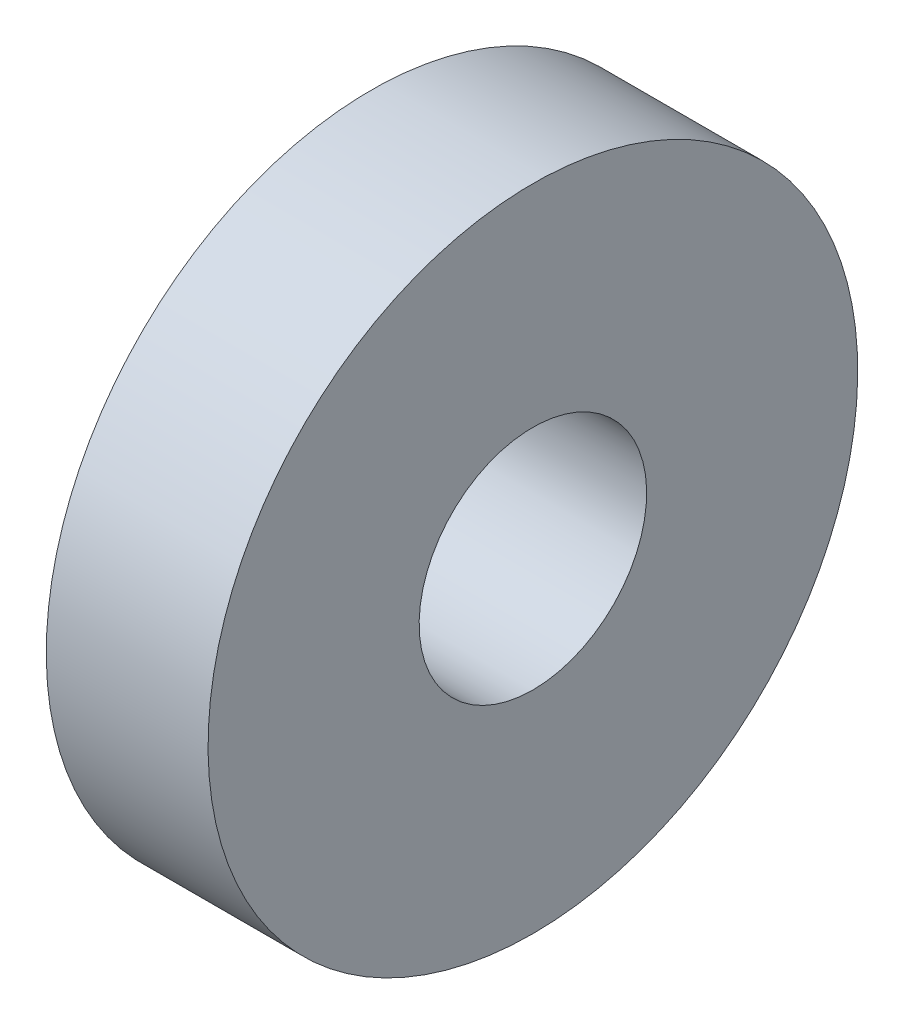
ISO-10303-21;
HEADER;
FILE_DESCRIPTION(('STEP AP214'),'2;1');
FILE_NAME('part.step','',(''),(''),'','','');
FILE_SCHEMA(('AUTOMOTIVE_DESIGN { 1 0 10303 214 1 1 1 1 }'));
ENDSEC;
DATA;
#1=APPLICATION_CONTEXT('core data for automotive mechanical design processes');
#2=APPLICATION_PROTOCOL_DEFINITION('international standard','automotive_design',2000,#1);
#3=PRODUCT_CONTEXT('',#1,'mechanical');
#4=PRODUCT('Part','Part','',(#3));
#5=PRODUCT_RELATED_PRODUCT_CATEGORY('part','',(#4));
#6=PRODUCT_DEFINITION_FORMATION('','',#4);
#7=PRODUCT_DEFINITION_CONTEXT('part definition',#1,'design');
#8=PRODUCT_DEFINITION('design','',#6,#7);
#9=PRODUCT_DEFINITION_SHAPE('','',#8);
#10=(LENGTH_UNIT() NAMED_UNIT(*) SI_UNIT(.MILLI.,.METRE.));
#11=(NAMED_UNIT(*) PLANE_ANGLE_UNIT() SI_UNIT($,.RADIAN.));
#12=(NAMED_UNIT(*) SI_UNIT($,.STERADIAN.) SOLID_ANGLE_UNIT());
#13=UNCERTAINTY_MEASURE_WITH_UNIT(LENGTH_MEASURE(1.E-05),#10,'distance_accuracy_value','');
#14=(GEOMETRIC_REPRESENTATION_CONTEXT(3) GLOBAL_UNCERTAINTY_ASSIGNED_CONTEXT((#13)) GLOBAL_UNIT_ASSIGNED_CONTEXT((#10,
#11,#12)) REPRESENTATION_CONTEXT('',''));
#15=CARTESIAN_POINT('',(0.,0.,0.));
#16=DIRECTION('',(0.,0.,1.));
#17=DIRECTION('',(1.,0.,0.));
#18=AXIS2_PLACEMENT_3D('',#15,#16,#17);
#19=CARTESIAN_POINT('',(-7.1,0.,0.));
#20=DIRECTION('',(-1.,0.,0.));
#21=DIRECTION('',(0.,0.,1.));
#22=AXIS2_PLACEMENT_3D('',#19,#20,#21);
#23=PLANE('',#22);
#24=CARTESIAN_POINT('',(-7.1,0.,0.));
#25=DIRECTION('',(1.,0.,0.));
#26=DIRECTION('',(0.,1.,0.));
#27=AXIS2_PLACEMENT_3D('',#24,#25,#26);
#28=CIRCLE('',#27,2.25);
#29=CARTESIAN_POINT('',(-7.1,-2.25,0.));
#30=VERTEX_POINT('',#29);
#31=EDGE_CURVE('E53',#30,#30,#28,.T.);
#32=ORIENTED_EDGE('',*,*,#31,.F.);
#33=EDGE_LOOP('',(#32));
#34=FACE_BOUND('',#33,.T.);
#35=CARTESIAN_POINT('',(-7.1,0.,0.));
#36=DIRECTION('',(-1.,0.,0.));
#37=DIRECTION('',(0.,1.,0.));
#38=AXIS2_PLACEMENT_3D('',#35,#36,#37);
#39=CIRCLE('',#38,6.425);
#40=CARTESIAN_POINT('',(-7.1,-6.425,0.));
#41=VERTEX_POINT('',#40);
#42=EDGE_CURVE('E11',#41,#41,#39,.T.);
#43=ORIENTED_EDGE('',*,*,#42,.F.);
#44=EDGE_LOOP('',(#43));
#45=FACE_BOUND('',#44,.T.);
#46=ADVANCED_FACE('F16',(#34,#45),#23,.F.);
#47=CARTESIAN_POINT('',(-10.3,0.,0.));
#48=DIRECTION('',(-1.,0.,0.));
#49=DIRECTION('',(0.,0.,1.));
#50=AXIS2_PLACEMENT_3D('',#47,#48,#49);
#51=PLANE('',#50);
#52=CARTESIAN_POINT('',(-10.3,0.,0.));
#53=DIRECTION('',(1.,0.,0.));
#54=DIRECTION('',(0.,1.,0.));
#55=AXIS2_PLACEMENT_3D('',#52,#53,#54);
#56=CIRCLE('',#55,2.25);
#57=CARTESIAN_POINT('',(-10.3,-2.25,0.));
#58=VERTEX_POINT('',#57);
#59=EDGE_CURVE('E65',#58,#58,#56,.T.);
#60=ORIENTED_EDGE('',*,*,#59,.T.);
#61=EDGE_LOOP('',(#60));
#62=FACE_BOUND('',#61,.T.);
#63=CARTESIAN_POINT('',(-10.3,0.,0.));
#64=DIRECTION('',(-1.,0.,0.));
#65=DIRECTION('',(0.,1.,0.));
#66=AXIS2_PLACEMENT_3D('',#63,#64,#65);
#67=CIRCLE('',#66,6.425);
#68=CARTESIAN_POINT('',(-10.3,-6.425,0.));
#69=VERTEX_POINT('',#68);
#70=EDGE_CURVE('E56',#69,#69,#67,.T.);
#71=ORIENTED_EDGE('',*,*,#70,.T.);
#72=EDGE_LOOP('',(#71));
#73=FACE_BOUND('',#72,.T.);
#74=ADVANCED_FACE('F73',(#62,#73),#51,.T.);
#75=CARTESIAN_POINT('',(-7.1,0.,0.));
#76=DIRECTION('',(-1.,0.,0.));
#77=DIRECTION('',(0.,1.,0.));
#78=AXIS2_PLACEMENT_3D('',#75,#76,#77);
#79=CYLINDRICAL_SURFACE('',#78,6.425);
#80=ORIENTED_EDGE('',*,*,#70,.F.);
#81=DIRECTION('',(1.,0.,0.));
#82=VECTOR('',#81,1.);
#83=CARTESIAN_POINT('',(-7.1,-6.425,0.));
#84=LINE('',#83,#82);
#85=EDGE_CURVE('E26',#69,#41,#84,.T.);
#86=ORIENTED_EDGE('',*,*,#85,.T.);
#87=ORIENTED_EDGE('',*,*,#42,.T.);
#88=ORIENTED_EDGE('',*,*,#85,.F.);
#89=EDGE_LOOP('',(#80,#86,#87,#88));
#90=FACE_BOUND('',#89,.T.);
#91=ADVANCED_FACE('F71',(#90),#79,.T.);
#92=CARTESIAN_POINT('',(-7.1,0.,0.));
#93=DIRECTION('',(-1.,0.,0.));
#94=DIRECTION('',(0.,1.,0.));
#95=AXIS2_PLACEMENT_3D('',#92,#93,#94);
#96=CYLINDRICAL_SURFACE('',#95,2.25);
#97=ORIENTED_EDGE('',*,*,#59,.F.);
#98=DIRECTION('',(1.,0.,0.));
#99=VECTOR('',#98,1.);
#100=CARTESIAN_POINT('',(-7.1,-2.25,0.));
#101=LINE('',#100,#99);
#102=EDGE_CURVE('E47',#58,#30,#101,.T.);
#103=ORIENTED_EDGE('',*,*,#102,.T.);
#104=ORIENTED_EDGE('',*,*,#31,.T.);
#105=ORIENTED_EDGE('',*,*,#102,.F.);
#106=EDGE_LOOP('',(#97,#103,#104,#105));
#107=FACE_BOUND('',#106,.T.);
#108=ADVANCED_FACE('F18',(#107),#96,.F.);
#109=CLOSED_SHELL('',(#46,#74,#91,#108));
#110=MANIFOLD_SOLID_BREP('B1',#109);
#111=ADVANCED_BREP_SHAPE_REPRESENTATION('',(#18,#110),#14);
#112=SHAPE_DEFINITION_REPRESENTATION(#9,#111);
ENDSEC;
END-ISO-10303-21;
